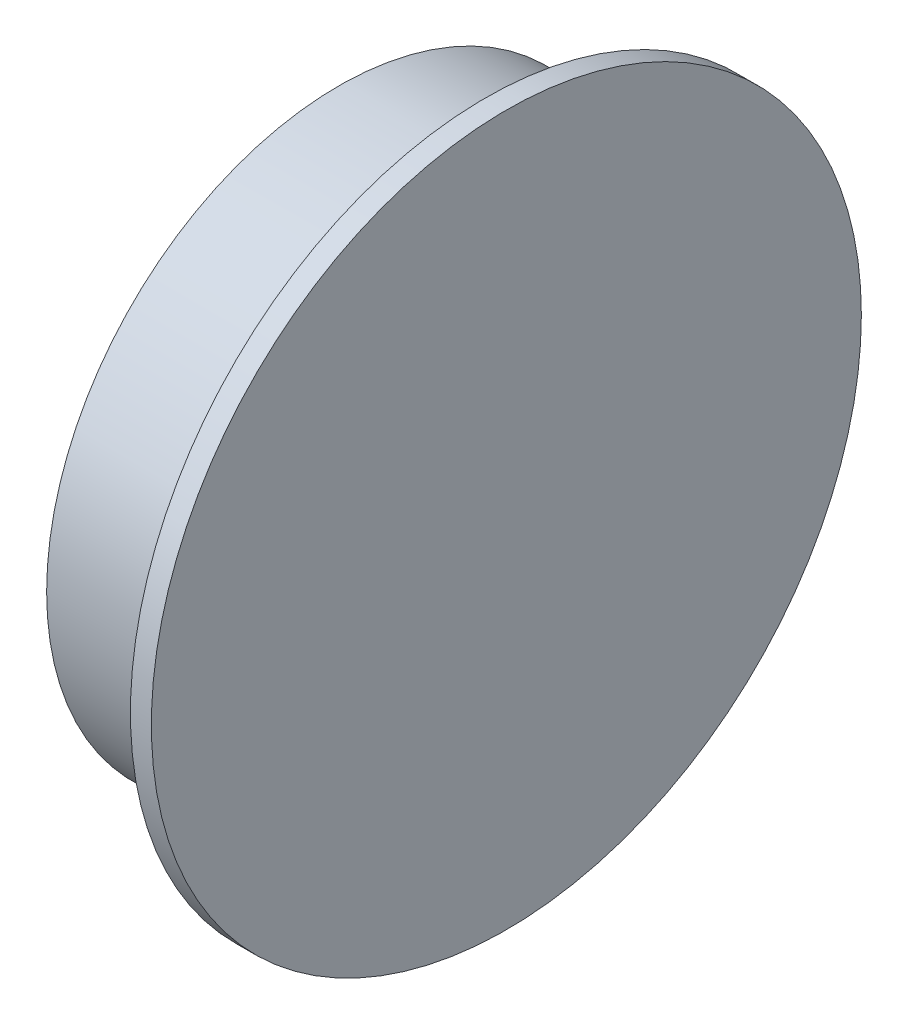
ISO-10303-21;
HEADER;
FILE_DESCRIPTION(('STEP AP214'),'2;1');
FILE_NAME('part.step','',(''),(''),'','','');
FILE_SCHEMA(('AUTOMOTIVE_DESIGN { 1 0 10303 214 1 1 1 1 }'));
ENDSEC;
DATA;
#1=APPLICATION_CONTEXT('core data for automotive mechanical design processes');
#2=APPLICATION_PROTOCOL_DEFINITION('international standard','automotive_design',2000,#1);
#3=PRODUCT_CONTEXT('',#1,'mechanical');
#4=PRODUCT('Part','Part','',(#3));
#5=PRODUCT_RELATED_PRODUCT_CATEGORY('part','',(#4));
#6=PRODUCT_DEFINITION_FORMATION('','',#4);
#7=PRODUCT_DEFINITION_CONTEXT('part definition',#1,'design');
#8=PRODUCT_DEFINITION('design','',#6,#7);
#9=PRODUCT_DEFINITION_SHAPE('','',#8);
#10=(LENGTH_UNIT() NAMED_UNIT(*) SI_UNIT(.MILLI.,.METRE.));
#11=(NAMED_UNIT(*) PLANE_ANGLE_UNIT() SI_UNIT($,.RADIAN.));
#12=(NAMED_UNIT(*) SI_UNIT($,.STERADIAN.) SOLID_ANGLE_UNIT());
#13=UNCERTAINTY_MEASURE_WITH_UNIT(LENGTH_MEASURE(1.E-05),#10,'distance_accuracy_value','');
#14=(GEOMETRIC_REPRESENTATION_CONTEXT(3) GLOBAL_UNCERTAINTY_ASSIGNED_CONTEXT((#13)) GLOBAL_UNIT_ASSIGNED_CONTEXT((#10,
#11,#12)) REPRESENTATION_CONTEXT('',''));
#15=CARTESIAN_POINT('',(0.,0.,0.));
#16=DIRECTION('',(0.,0.,1.));
#17=DIRECTION('',(1.,0.,0.));
#18=AXIS2_PLACEMENT_3D('',#15,#16,#17);
#19=CARTESIAN_POINT('',(-5.5,12.75,0.));
#20=DIRECTION('',(1.,0.,0.));
#21=DIRECTION('',(0.,0.,-1.));
#22=AXIS2_PLACEMENT_3D('',#19,#20,#21);
#23=PLANE('',#22);
#24=CARTESIAN_POINT('',(-5.5,0.,0.));
#25=DIRECTION('',(1.,0.,0.));
#26=DIRECTION('',(0.,0.,-1.));
#27=AXIS2_PLACEMENT_3D('',#24,#25,#26);
#28=CIRCLE('',#27,13.25);
#29=CARTESIAN_POINT('',(-5.5,0.,-13.25));
#30=VERTEX_POINT('',#29);
#31=EDGE_CURVE('E41',#30,#30,#28,.T.);
#32=ORIENTED_EDGE('',*,*,#31,.T.);
#33=EDGE_LOOP('',(#32));
#34=FACE_BOUND('',#33,.T.);
#35=CARTESIAN_POINT('',(-5.5,0.,0.));
#36=DIRECTION('',(-1.,0.,0.));
#37=DIRECTION('',(0.,0.,1.));
#38=AXIS2_PLACEMENT_3D('',#35,#36,#37);
#39=CIRCLE('',#38,13.95);
#40=CARTESIAN_POINT('',(-5.5,0.,13.95));
#41=VERTEX_POINT('',#40);
#42=EDGE_CURVE('E50',#41,#41,#39,.T.);
#43=ORIENTED_EDGE('',*,*,#42,.T.);
#44=EDGE_LOOP('',(#43));
#45=FACE_BOUND('',#44,.T.);
#46=ADVANCED_FACE('F30',(#34,#45),#23,.F.);
#47=CARTESIAN_POINT('',(-7.21543394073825,0.,0.));
#48=DIRECTION('',(-1.,0.,0.));
#49=DIRECTION('',(0.,0.,1.));
#50=AXIS2_PLACEMENT_3D('',#47,#48,#49);
#51=CYLINDRICAL_SURFACE('',#50,13.95);
#52=CARTESIAN_POINT('',(0.3,0.,0.));
#53=DIRECTION('',(1.,0.,0.));
#54=DIRECTION('',(0.,0.,-1.));
#55=AXIS2_PLACEMENT_3D('',#52,#53,#54);
#56=CIRCLE('',#55,13.95);
#57=CARTESIAN_POINT('',(0.3,0.,-13.95));
#58=VERTEX_POINT('',#57);
#59=EDGE_CURVE('E10',#58,#58,#56,.F.);
#60=ORIENTED_EDGE('',*,*,#59,.T.);
#61=EDGE_LOOP('',(#60));
#62=FACE_BOUND('',#61,.T.);
#63=ORIENTED_EDGE('',*,*,#42,.F.);
#64=EDGE_LOOP('',(#63));
#65=FACE_BOUND('',#64,.T.);
#66=ADVANCED_FACE('F82',(#62,#65),#51,.T.);
#67=CARTESIAN_POINT('',(0.,12.75,0.));
#68=DIRECTION('',(1.,0.,0.));
#69=DIRECTION('',(0.,0.,-1.));
#70=AXIS2_PLACEMENT_3D('',#67,#68,#69);
#71=PLANE('',#70);
#72=CARTESIAN_POINT('',(0.,0.,0.));
#73=DIRECTION('',(-1.,0.,0.));
#74=DIRECTION('',(0.,0.,1.));
#75=AXIS2_PLACEMENT_3D('',#72,#73,#74);
#76=CIRCLE('',#75,12.75);
#77=CARTESIAN_POINT('',(0.,0.,12.75));
#78=VERTEX_POINT('',#77);
#79=EDGE_CURVE('E53',#78,#78,#76,.T.);
#80=ORIENTED_EDGE('',*,*,#79,.T.);
#81=EDGE_LOOP('',(#80));
#82=FACE_BOUND('',#81,.T.);
#83=ADVANCED_FACE('F88',(#82),#71,.F.);
#84=CARTESIAN_POINT('',(-7.21543394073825,0.,0.));
#85=DIRECTION('',(-1.,0.,0.));
#86=DIRECTION('',(0.,0.,1.));
#87=AXIS2_PLACEMENT_3D('',#84,#85,#86);
#88=CYLINDRICAL_SURFACE('',#87,12.75);
#89=CARTESIAN_POINT('',(-5.,0.,0.));
#90=DIRECTION('',(1.,0.,0.));
#91=DIRECTION('',(0.,0.,-1.));
#92=AXIS2_PLACEMENT_3D('',#89,#90,#91);
#93=CIRCLE('',#92,12.75);
#94=CARTESIAN_POINT('',(-5.,0.,-12.75));
#95=VERTEX_POINT('',#94);
#96=EDGE_CURVE('E45',#95,#95,#93,.F.);
#97=ORIENTED_EDGE('',*,*,#96,.T.);
#98=EDGE_LOOP('',(#97));
#99=FACE_BOUND('',#98,.T.);
#100=ORIENTED_EDGE('',*,*,#79,.F.);
#101=EDGE_LOOP('',(#100));
#102=FACE_BOUND('',#101,.T.);
#103=ADVANCED_FACE('F93',(#99,#102),#88,.F.);
#104=CARTESIAN_POINT('',(-5.,0.,0.));
#105=DIRECTION('',(-1.,0.,0.));
#106=DIRECTION('',(0.,0.,1.));
#107=AXIS2_PLACEMENT_3D('',#104,#105,#106);
#108=CONICAL_SURFACE('',#107,12.75,0.785398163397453);
#109=ORIENTED_EDGE('',*,*,#31,.F.);
#110=EDGE_LOOP('',(#109));
#111=FACE_BOUND('',#110,.T.);
#112=ORIENTED_EDGE('',*,*,#96,.F.);
#113=EDGE_LOOP('',(#112));
#114=FACE_BOUND('',#113,.T.);
#115=ADVANCED_FACE('F68',(#111,#114),#108,.F.);
#116=CARTESIAN_POINT('',(2.5,0.,0.));
#117=DIRECTION('',(-1.,0.,0.));
#118=DIRECTION('',(0.,0.,1.));
#119=AXIS2_PLACEMENT_3D('',#116,#117,#118);
#120=CYLINDRICAL_SURFACE('',#119,16.95);
#121=CARTESIAN_POINT('',(2.5,0.,0.));
#122=DIRECTION('',(1.,0.,0.));
#123=DIRECTION('',(0.,0.,-1.));
#124=AXIS2_PLACEMENT_3D('',#121,#122,#123);
#125=CIRCLE('',#124,16.95);
#126=CARTESIAN_POINT('',(2.5,0.,-16.95));
#127=VERTEX_POINT('',#126);
#128=EDGE_CURVE('E56',#127,#127,#125,.T.);
#129=ORIENTED_EDGE('',*,*,#128,.F.);
#130=EDGE_LOOP('',(#129));
#131=FACE_BOUND('',#130,.T.);
#132=CARTESIAN_POINT('',(1.5,0.,0.));
#133=DIRECTION('',(1.,0.,0.));
#134=DIRECTION('',(0.,0.,-1.));
#135=AXIS2_PLACEMENT_3D('',#132,#133,#134);
#136=CIRCLE('',#135,16.95);
#137=CARTESIAN_POINT('',(1.5,0.,-16.95));
#138=VERTEX_POINT('',#137);
#139=EDGE_CURVE('E57',#138,#138,#136,.T.);
#140=ORIENTED_EDGE('',*,*,#139,.T.);
#141=EDGE_LOOP('',(#140));
#142=FACE_BOUND('',#141,.T.);
#143=ADVANCED_FACE('F65',(#131,#142),#120,.T.);
#144=CARTESIAN_POINT('',(2.5,0.,0.));
#145=DIRECTION('',(1.,0.,0.));
#146=DIRECTION('',(0.,0.,-1.));
#147=AXIS2_PLACEMENT_3D('',#144,#145,#146);
#148=PLANE('',#147);
#149=ORIENTED_EDGE('',*,*,#128,.T.);
#150=EDGE_LOOP('',(#149));
#151=FACE_BOUND('',#150,.T.);
#152=ADVANCED_FACE('F63',(#151),#148,.T.);
#153=CARTESIAN_POINT('',(1.5,0.,0.));
#154=DIRECTION('',(1.,0.,0.));
#155=DIRECTION('',(0.,0.,-1.));
#156=AXIS2_PLACEMENT_3D('',#153,#154,#155);
#157=PLANE('',#156);
#158=CARTESIAN_POINT('',(1.5,0.,0.));
#159=DIRECTION('',(1.,0.,0.));
#160=DIRECTION('',(0.,0.,-1.));
#161=AXIS2_PLACEMENT_3D('',#158,#159,#160);
#162=CIRCLE('',#161,15.15);
#163=CARTESIAN_POINT('',(1.5,0.,-15.15));
#164=VERTEX_POINT('',#163);
#165=EDGE_CURVE('E37',#164,#164,#162,.T.);
#166=ORIENTED_EDGE('',*,*,#165,.T.);
#167=EDGE_LOOP('',(#166));
#168=FACE_BOUND('',#167,.T.);
#169=ORIENTED_EDGE('',*,*,#139,.F.);
#170=EDGE_LOOP('',(#169));
#171=FACE_BOUND('',#170,.T.);
#172=ADVANCED_FACE('F72',(#168,#171),#157,.F.);
#173=CARTESIAN_POINT('',(0.3,0.,0.));
#174=DIRECTION('',(1.,0.,0.));
#175=DIRECTION('',(0.,0.,-1.));
#176=AXIS2_PLACEMENT_3D('',#173,#174,#175);
#177=TOROIDAL_SURFACE('',#176,15.15,1.2);
#178=ORIENTED_EDGE('',*,*,#59,.F.);
#179=EDGE_LOOP('',(#178));
#180=FACE_BOUND('',#179,.T.);
#181=ORIENTED_EDGE('',*,*,#165,.F.);
#182=EDGE_LOOP('',(#181));
#183=FACE_BOUND('',#182,.T.);
#184=ADVANCED_FACE('F32',(#180,#183),#177,.F.);
#185=CLOSED_SHELL('',(#46,#66,#83,#103,#115,#143,#152,#172,#184));
#186=MANIFOLD_SOLID_BREP('B2',#185);
#187=ADVANCED_BREP_SHAPE_REPRESENTATION('',(#18,#186),#14);
#188=SHAPE_DEFINITION_REPRESENTATION(#9,#187);
ENDSEC;
END-ISO-10303-21;
